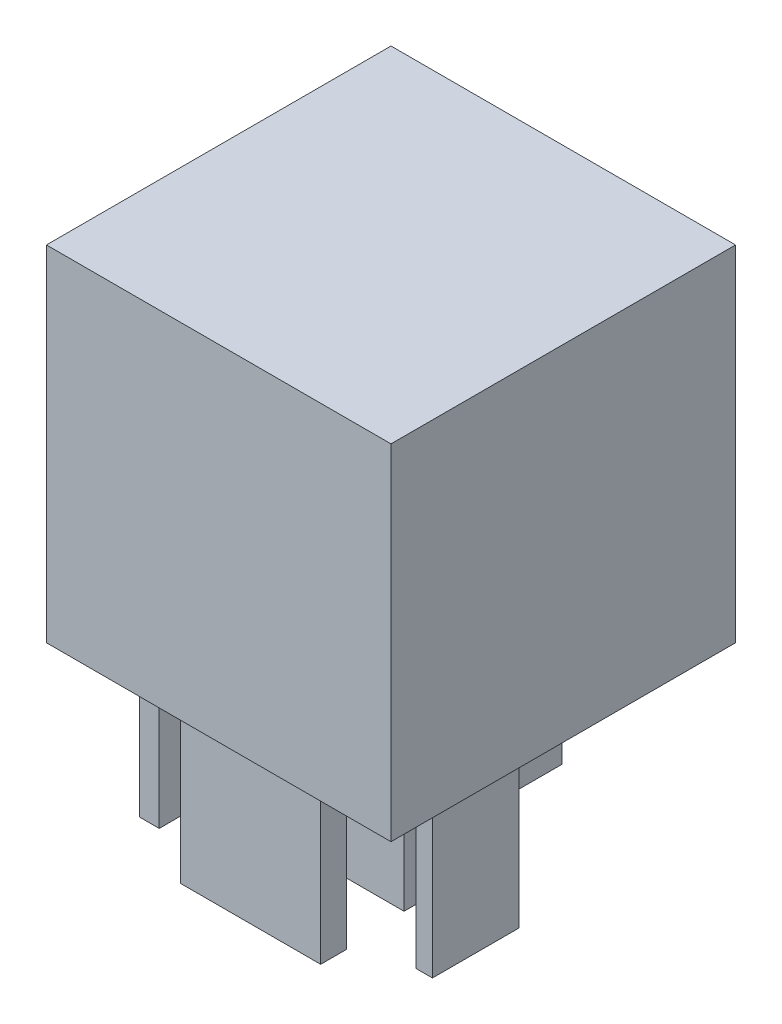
from build123d import *

# Parameters (mm, degrees)
ESQUISSE1_W        = 40
ESQUISSE1_H        = 40
BOSS_EXTRU_1_DEPTH = 20
ESQUISSE2_W        = 16.271954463
ESQUISSE2_H        = 2.968532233
ESQUISSE2_W_2      = 15.997090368
ESQUISSE2_H_2      = 3.628206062
ESQUISSE2_W_3      = 3.79312452
ESQUISSE2_H_3      = 14.347905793
ESQUISSE2_W_4      = 1.924048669
ESQUISSE2_H_4      = 10.060025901
ESQUISSE2_W_5      = 2.308858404
ESQUISSE2_H_5      = 11.434346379
BOSS_EXTRU_2_DEPTH = 20


with BuildPart() as part:
    # Esquisse1 → Boss.-Extru.1 (new, symmetric)
    with BuildSketch(Plane.XY):
        with Locations((0, 20)):
            Rectangle(ESQUISSE1_W, ESQUISSE1_H)
    extrude(amount=BOSS_EXTRU_1_DEPTH, both=True)

    # Esquisse2 → Boss.-Extru.2 (add)
    with BuildSketch(Plane.XZ):
        with Locations((0.109945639, 14.925120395)):
            Rectangle(ESQUISSE2_W, ESQUISSE2_H)
        with Locations((-0.247377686, 4.42531194)):
            Rectangle(ESQUISSE2_W_2, ESQUISSE2_H_2)
        with Locations((0.247377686, -10.554781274)):
            Rectangle(ESQUISSE2_W_3, ESQUISSE2_H_3)
        with Locations((15.145011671, 6.266901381)):
            Rectangle(ESQUISSE2_W_4, ESQUISSE2_H_4)
        with Locations((-15.942117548, 6.404333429)):
            Rectangle(ESQUISSE2_W_5, ESQUISSE2_H_5)
    extrude(amount=BOSS_EXTRU_2_DEPTH)


solid = part.part
